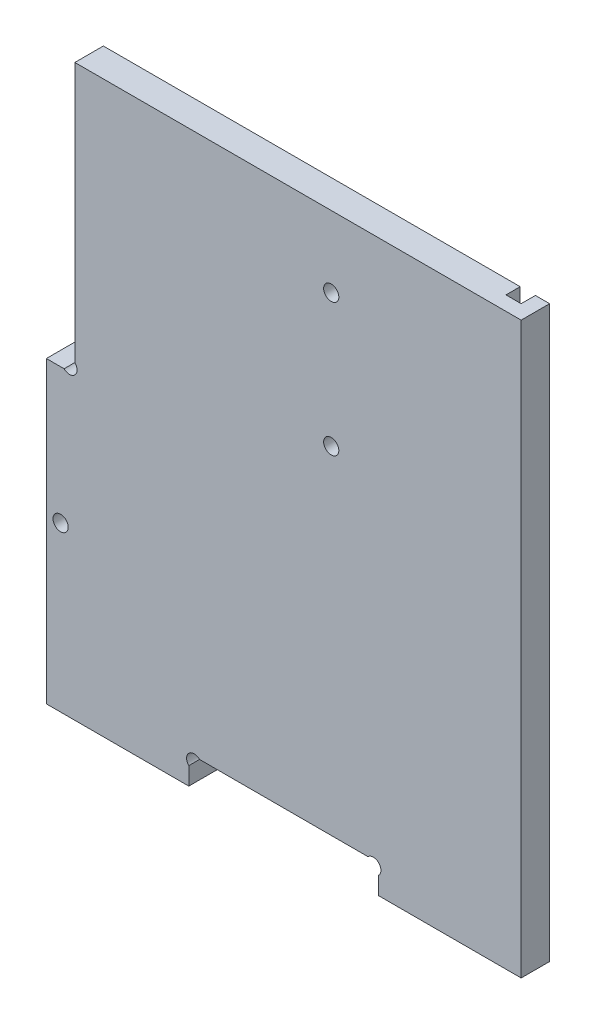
from build123d import *

# Parameters (mm, degrees)
ESQUISSE1_R             = 1.6
BOSS_EXTRU_1_DEPTH      = 6
ESQUISSE2_R             = 1.1
ENL_V_MAT_EXTRU_1_DEPTH = 1
ESQUISSE3_W             = 3.2
ESQUISSE3_H             = 125.368849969
ENL_V_MAT_EXTRU_2_DEPTH = 3


with BuildPart() as part:
    # Esquisse1 → Boss.-Extru.1 (new body)
    with BuildSketch(Plane.XY):
        with BuildLine():
            Line((-44, 114), (50, 114))
            Line((50, 114), (50, -6))
            Line((50, -6), (20, -6))
            Line((20, -6), (20, -2.2627417))
            ThreePointArc((20, -2.2627417), (20, 0), (17.7372583, 0))
            Line((17.7372583, 0), (-17.7372583, 0))
            ThreePointArc((-17.7372583, 0), (-20, 0), (-20, -2.2627417))
            Line((-20, -2.2627417), (-20, -6))
            Line((-20, -6), (-50, -6))
            Line((-50, -6), (-50, 57))
            Line((-50, 57), (-46.2627417, 57))
            ThreePointArc((-46.2627417, 57), (-44, 57), (-44, 59.2627417))
            Line((-44, 59.2627417), (-44, 114))
        make_face()
        with Locations(Location((10, 71, 0), (0, 0, 180))):
            Circle(ESQUISSE1_R, mode=Mode.SUBTRACT)
        with Locations((10, 99)):
            Circle(ESQUISSE1_R, mode=Mode.SUBTRACT)
        with Locations(Location((-47, 28.5, 0), (0, 0, 180))):
            Circle(ESQUISSE1_R, mode=Mode.SUBTRACT)
    extrude(amount=BOSS_EXTRU_1_DEPTH)

    # Esquisse2 → Enl_v. mat.-Extru.1 (cut)
    with BuildSketch(Plane(origin=(0, 0, 0), x_dir=(-1, 0, 0), z_dir=(0, 0, -1))):
        with Locations((-17.5, 99)):
            Circle(ESQUISSE2_R)
        with Locations(Location((-2.5, 99, 0), (0, 0, 180))):
            Circle(ESQUISSE2_R)
        with Locations((-10, 78.5)):
            Circle(ESQUISSE2_R)
        with Locations((-10, 63.5)):
            Circle(ESQUISSE2_R)
    extrude(amount=-ENL_V_MAT_EXTRU_1_DEPTH, mode=Mode.SUBTRACT)

    # Esquisse3 → Enl_v. mat.-Extru.2 (cut)
    with BuildSketch(Plane(origin=(0, 0, 0), x_dir=(-1, 0, 0), z_dir=(0, 0, -1))):
        with Locations((-45.4, 53.346630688)):
            Rectangle(ESQUISSE3_W, ESQUISSE3_H)
    extrude(amount=-ENL_V_MAT_EXTRU_2_DEPTH, mode=Mode.SUBTRACT)


solid = part.part
